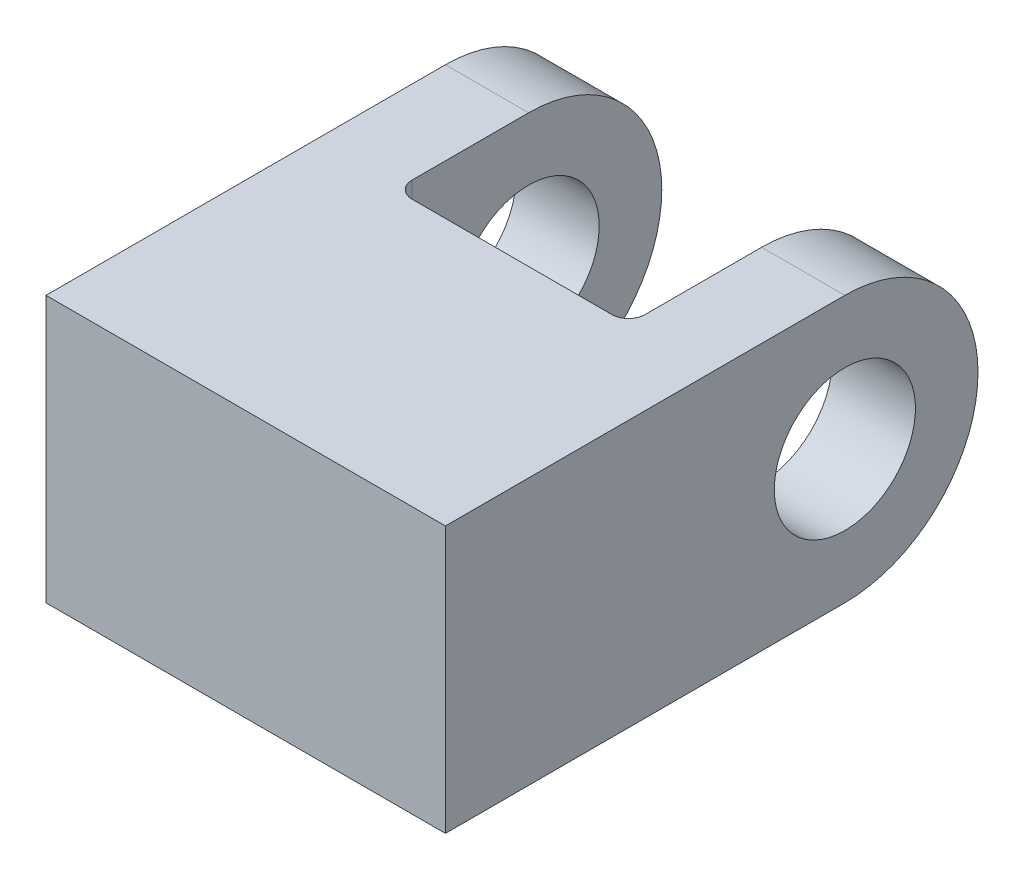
ISO-10303-21;
HEADER;
FILE_DESCRIPTION(('STEP AP214'),'2;1');
FILE_NAME('part.step','',(''),(''),'','','');
FILE_SCHEMA(('AUTOMOTIVE_DESIGN { 1 0 10303 214 1 1 1 1 }'));
ENDSEC;
DATA;
#1=APPLICATION_CONTEXT('core data for automotive mechanical design processes');
#2=APPLICATION_PROTOCOL_DEFINITION('international standard','automotive_design',2000,#1);
#3=PRODUCT_CONTEXT('',#1,'mechanical');
#4=PRODUCT('Part','Part','',(#3));
#5=PRODUCT_RELATED_PRODUCT_CATEGORY('part','',(#4));
#6=PRODUCT_DEFINITION_FORMATION('','',#4);
#7=PRODUCT_DEFINITION_CONTEXT('part definition',#1,'design');
#8=PRODUCT_DEFINITION('design','',#6,#7);
#9=PRODUCT_DEFINITION_SHAPE('','',#8);
#10=(LENGTH_UNIT() NAMED_UNIT(*) SI_UNIT(.MILLI.,.METRE.));
#11=(NAMED_UNIT(*) PLANE_ANGLE_UNIT() SI_UNIT($,.RADIAN.));
#12=(NAMED_UNIT(*) SI_UNIT($,.STERADIAN.) SOLID_ANGLE_UNIT());
#13=UNCERTAINTY_MEASURE_WITH_UNIT(LENGTH_MEASURE(1.E-05),#10,'distance_accuracy_value','');
#14=(GEOMETRIC_REPRESENTATION_CONTEXT(3) GLOBAL_UNCERTAINTY_ASSIGNED_CONTEXT((#13)) GLOBAL_UNIT_ASSIGNED_CONTEXT((#10,
#11,#12)) REPRESENTATION_CONTEXT('',''));
#15=CARTESIAN_POINT('',(0.,0.,0.));
#16=DIRECTION('',(0.,0.,1.));
#17=DIRECTION('',(1.,0.,0.));
#18=AXIS2_PLACEMENT_3D('',#15,#16,#17);
#19=CARTESIAN_POINT('',(19.05,0.,0.));
#20=DIRECTION('',(-1.,0.,0.));
#21=DIRECTION('',(0.,0.,1.));
#22=AXIS2_PLACEMENT_3D('',#19,#20,#21);
#23=CYLINDRICAL_SURFACE('',#22,12.7);
#24=DIRECTION('',(-1.,0.,0.));
#25=VECTOR('',#24,1.);
#26=CARTESIAN_POINT('',(19.05,-12.7,0.));
#27=LINE('',#26,#25);
#28=CARTESIAN_POINT('',(19.05,-12.7,0.));
#29=VERTEX_POINT('',#28);
#30=CARTESIAN_POINT('',(11.1125,-12.7,0.));
#31=VERTEX_POINT('',#30);
#32=EDGE_CURVE('E215',#29,#31,#27,.T.);
#33=ORIENTED_EDGE('',*,*,#32,.T.);
#34=CARTESIAN_POINT('',(11.1125,0.,0.));
#35=DIRECTION('',(1.,0.,0.));
#36=DIRECTION('',(0.,0.,-1.));
#37=AXIS2_PLACEMENT_3D('',#34,#35,#36);
#38=CIRCLE('',#37,12.7);
#39=CARTESIAN_POINT('',(11.1125,12.7,0.));
#40=VERTEX_POINT('',#39);
#41=EDGE_CURVE('E152',#31,#40,#38,.T.);
#42=ORIENTED_EDGE('',*,*,#41,.T.);
#43=DIRECTION('',(-1.,0.,0.));
#44=VECTOR('',#43,1.);
#45=CARTESIAN_POINT('',(19.05,12.7,0.));
#46=LINE('',#45,#44);
#47=CARTESIAN_POINT('',(19.05,12.7,0.));
#48=VERTEX_POINT('',#47);
#49=EDGE_CURVE('E138',#48,#40,#46,.T.);
#50=ORIENTED_EDGE('',*,*,#49,.F.);
#51=CARTESIAN_POINT('',(19.05,0.,0.));
#52=DIRECTION('',(1.,0.,0.));
#53=DIRECTION('',(0.,0.,-1.));
#54=AXIS2_PLACEMENT_3D('',#51,#52,#53);
#55=CIRCLE('',#54,12.7);
#56=EDGE_CURVE('E197',#29,#48,#55,.T.);
#57=ORIENTED_EDGE('',*,*,#56,.F.);
#58=EDGE_LOOP('',(#33,#42,#50,#57));
#59=FACE_BOUND('',#58,.T.);
#60=ADVANCED_FACE('F43',(#59),#23,.T.);
#61=CARTESIAN_POINT('',(19.05,0.,0.));
#62=DIRECTION('',(-1.,0.,0.));
#63=DIRECTION('',(0.,0.,1.));
#64=AXIS2_PLACEMENT_3D('',#61,#62,#63);
#65=CYLINDRICAL_SURFACE('',#64,6.731);
#66=CARTESIAN_POINT('',(11.1125,0.,0.));
#67=DIRECTION('',(1.,0.,0.));
#68=DIRECTION('',(0.,0.,-1.));
#69=AXIS2_PLACEMENT_3D('',#66,#67,#68);
#70=CIRCLE('',#69,6.731);
#71=CARTESIAN_POINT('',(11.1125,0.,6.731));
#72=VERTEX_POINT('',#71);
#73=EDGE_CURVE('E124',#72,#72,#70,.T.);
#74=CARTESIAN_POINT('',(19.05,0.,0.));
#75=DIRECTION('',(1.,0.,0.));
#76=DIRECTION('',(0.,0.,-1.));
#77=AXIS2_PLACEMENT_3D('',#74,#75,#76);
#78=CIRCLE('',#77,6.731);
#79=CARTESIAN_POINT('',(19.05,0.,6.731));
#80=VERTEX_POINT('',#79);
#81=EDGE_CURVE('E192',#80,#80,#78,.T.);
#82=CARTESIAN_POINT('',(11.1125,0.,6.731));
#83=CARTESIAN_POINT('',(11.1951822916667,0.,6.731));
#84=CARTESIAN_POINT('',(11.2778645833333,0.,6.731));
#85=CARTESIAN_POINT('',(11.4432291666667,0.,6.731));
#86=CARTESIAN_POINT('',(11.5259114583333,0.,6.731));
#87=CARTESIAN_POINT('',(11.6912760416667,0.,6.731));
#88=CARTESIAN_POINT('',(11.7739583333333,0.,6.731));
#89=CARTESIAN_POINT('',(11.9393229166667,0.,6.731));
#90=CARTESIAN_POINT('',(12.0220052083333,0.,6.731));
#91=CARTESIAN_POINT('',(12.1873697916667,0.,6.731));
#92=CARTESIAN_POINT('',(12.2700520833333,0.,6.731));
#93=CARTESIAN_POINT('',(12.4354166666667,0.,6.731));
#94=CARTESIAN_POINT('',(12.5180989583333,0.,6.731));
#95=CARTESIAN_POINT('',(12.6834635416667,0.,6.731));
#96=CARTESIAN_POINT('',(12.7661458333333,0.,6.731));
#97=CARTESIAN_POINT('',(12.9315104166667,0.,6.731));
#98=CARTESIAN_POINT('',(13.0141927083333,0.,6.731));
#99=CARTESIAN_POINT('',(13.1795572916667,0.,6.731));
#100=CARTESIAN_POINT('',(13.2622395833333,0.,6.731));
#101=CARTESIAN_POINT('',(13.4276041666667,0.,6.731));
#102=CARTESIAN_POINT('',(13.5102864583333,0.,6.731));
#103=CARTESIAN_POINT('',(13.6756510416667,0.,6.731));
#104=CARTESIAN_POINT('',(13.7583333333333,0.,6.731));
#105=CARTESIAN_POINT('',(13.9236979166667,0.,6.731));
#106=CARTESIAN_POINT('',(14.0063802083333,0.,6.731));
#107=CARTESIAN_POINT('',(14.1717447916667,0.,6.731));
#108=CARTESIAN_POINT('',(14.2544270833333,0.,6.731));
#109=CARTESIAN_POINT('',(14.4197916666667,0.,6.731));
#110=CARTESIAN_POINT('',(14.5024739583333,0.,6.731));
#111=CARTESIAN_POINT('',(14.6678385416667,0.,6.731));
#112=CARTESIAN_POINT('',(14.7505208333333,0.,6.731));
#113=CARTESIAN_POINT('',(14.9158854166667,0.,6.731));
#114=CARTESIAN_POINT('',(14.9985677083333,0.,6.731));
#115=CARTESIAN_POINT('',(15.1639322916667,0.,6.731));
#116=CARTESIAN_POINT('',(15.2466145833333,0.,6.731));
#117=CARTESIAN_POINT('',(15.4119791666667,0.,6.731));
#118=CARTESIAN_POINT('',(15.4946614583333,0.,6.731));
#119=CARTESIAN_POINT('',(15.6600260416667,0.,6.731));
#120=CARTESIAN_POINT('',(15.7427083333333,0.,6.731));
#121=CARTESIAN_POINT('',(15.9080729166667,0.,6.731));
#122=CARTESIAN_POINT('',(15.9907552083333,0.,6.731));
#123=CARTESIAN_POINT('',(16.1561197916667,0.,6.731));
#124=CARTESIAN_POINT('',(16.2388020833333,0.,6.731));
#125=CARTESIAN_POINT('',(16.4041666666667,0.,6.731));
#126=CARTESIAN_POINT('',(16.4868489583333,0.,6.731));
#127=CARTESIAN_POINT('',(16.6522135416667,0.,6.731));
#128=CARTESIAN_POINT('',(16.7348958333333,0.,6.731));
#129=CARTESIAN_POINT('',(16.9002604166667,0.,6.731));
#130=CARTESIAN_POINT('',(16.9829427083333,0.,6.731));
#131=CARTESIAN_POINT('',(17.1483072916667,0.,6.731));
#132=CARTESIAN_POINT('',(17.2309895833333,0.,6.731));
#133=CARTESIAN_POINT('',(17.3963541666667,0.,6.731));
#134=CARTESIAN_POINT('',(17.4790364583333,0.,6.731));
#135=CARTESIAN_POINT('',(17.6444010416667,0.,6.731));
#136=CARTESIAN_POINT('',(17.7270833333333,0.,6.731));
#137=CARTESIAN_POINT('',(17.8924479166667,0.,6.731));
#138=CARTESIAN_POINT('',(17.9751302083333,0.,6.731));
#139=CARTESIAN_POINT('',(18.1404947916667,0.,6.731));
#140=CARTESIAN_POINT('',(18.2231770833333,0.,6.731));
#141=CARTESIAN_POINT('',(18.3885416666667,0.,6.731));
#142=CARTESIAN_POINT('',(18.4712239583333,0.,6.731));
#143=CARTESIAN_POINT('',(18.6365885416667,0.,6.731));
#144=CARTESIAN_POINT('',(18.7192708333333,0.,6.731));
#145=CARTESIAN_POINT('',(18.8846354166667,0.,6.731));
#146=CARTESIAN_POINT('',(18.9673177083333,0.,6.731));
#147=CARTESIAN_POINT('',(19.05,0.,6.731));
#148=B_SPLINE_CURVE_WITH_KNOTS('',3,(#82,#83,#84,#85,#86,#87,#88,#89,#90,#91,#92,#93,#94,#95,
#96,#97,#98,#99,#100,#101,#102,#103,#104,#105,#106,#107,#108,#109,#110,#111,#112,#113,#114,#115,
#116,#117,#118,#119,#120,#121,#122,#123,#124,#125,#126,#127,#128,#129,#130,#131,#132,#133,#134,
#135,#136,#137,#138,#139,#140,#141,#142,#143,#144,#145,#146,#147),.UNSPECIFIED.,.F.,.F.,(4,2,2,
2,2,2,2,2,2,2,2,2,2,2,2,2,2,2,2,2,2,2,2,2,2,2,2,2,2,2,2,2,4),(0.,0.248046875,0.496093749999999,
0.744140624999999,0.9921875,1.240234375,1.48828125,1.736328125,1.984375,2.232421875,2.48046875,
2.728515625,2.9765625,3.224609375,3.47265625,3.720703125,3.96875,4.216796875,4.46484375,
4.712890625,4.9609375,5.208984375,5.45703125,5.705078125,5.953125,6.201171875,6.44921875,
6.697265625,6.9453125,7.193359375,7.44140625,7.689453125,7.9375),.UNSPECIFIED.);
#149=EDGE_CURVE('BSEAM235',#72,#80,#148,.T.);
#150=ORIENTED_EDGE('',*,*,#73,.F.);
#151=ORIENTED_EDGE('',*,*,#81,.T.);
#152=ORIENTED_EDGE('',*,*,#149,.T.);
#153=ORIENTED_EDGE('',*,*,#149,.F.);
#154=EDGE_LOOP('',(#150,#152,#151,#153));
#155=FACE_BOUND('',#154,.T.);
#156=ADVANCED_FACE('F235',(#155),#65,.F.);
#157=CARTESIAN_POINT('',(19.05,0.,0.));
#158=DIRECTION('',(1.,0.,0.));
#159=DIRECTION('',(0.,0.,-1.));
#160=AXIS2_PLACEMENT_3D('',#157,#158,#159);
#161=PLANE('',#160);
#162=ORIENTED_EDGE('',*,*,#56,.T.);
#163=DIRECTION('',(0.,0.,1.));
#164=VECTOR('',#163,1.);
#165=CARTESIAN_POINT('',(19.05,12.7,0.));
#166=LINE('',#165,#164);
#167=CARTESIAN_POINT('',(19.05,12.7,38.1));
#168=VERTEX_POINT('',#167);
#169=EDGE_CURVE('E200',#48,#168,#166,.T.);
#170=ORIENTED_EDGE('',*,*,#169,.T.);
#171=DIRECTION('',(0.,-1.,0.));
#172=VECTOR('',#171,1.);
#173=CARTESIAN_POINT('',(19.05,12.7,38.1));
#174=LINE('',#173,#172);
#175=CARTESIAN_POINT('',(19.05,-12.7,38.1));
#176=VERTEX_POINT('',#175);
#177=EDGE_CURVE('E203',#168,#176,#174,.T.);
#178=ORIENTED_EDGE('',*,*,#177,.T.);
#179=DIRECTION('',(0.,0.,-1.));
#180=VECTOR('',#179,1.);
#181=CARTESIAN_POINT('',(19.05,-12.7,38.1));
#182=LINE('',#181,#180);
#183=EDGE_CURVE('E205',#176,#29,#182,.T.);
#184=ORIENTED_EDGE('',*,*,#183,.T.);
#185=EDGE_LOOP('',(#162,#170,#178,#184));
#186=FACE_BOUND('',#185,.T.);
#187=ORIENTED_EDGE('',*,*,#81,.F.);
#188=EDGE_LOOP('',(#187));
#189=FACE_BOUND('',#188,.T.);
#190=ADVANCED_FACE('F229',(#186,#189),#161,.T.);
#191=CARTESIAN_POINT('',(-19.05,0.,0.));
#192=DIRECTION('',(1.,0.,0.));
#193=DIRECTION('',(0.,0.,-1.));
#194=AXIS2_PLACEMENT_3D('',#191,#192,#193);
#195=PLANE('',#194);
#196=CARTESIAN_POINT('',(-19.05,0.,0.));
#197=DIRECTION('',(1.,0.,0.));
#198=DIRECTION('',(0.,0.,-1.));
#199=AXIS2_PLACEMENT_3D('',#196,#197,#198);
#200=CIRCLE('',#199,12.7);
#201=CARTESIAN_POINT('',(-19.05,-12.7,0.));
#202=VERTEX_POINT('',#201);
#203=CARTESIAN_POINT('',(-19.05,12.7,0.));
#204=VERTEX_POINT('',#203);
#205=EDGE_CURVE('E137',#202,#204,#200,.T.);
#206=ORIENTED_EDGE('',*,*,#205,.F.);
#207=DIRECTION('',(0.,0.,-1.));
#208=VECTOR('',#207,1.);
#209=CARTESIAN_POINT('',(-19.05,-12.7,38.1));
#210=LINE('',#209,#208);
#211=CARTESIAN_POINT('',(-19.05,-12.7,38.1));
#212=VERTEX_POINT('',#211);
#213=EDGE_CURVE('E201',#212,#202,#210,.T.);
#214=ORIENTED_EDGE('',*,*,#213,.F.);
#215=DIRECTION('',(0.,-1.,0.));
#216=VECTOR('',#215,1.);
#217=CARTESIAN_POINT('',(-19.05,12.7,38.1));
#218=LINE('',#217,#216);
#219=CARTESIAN_POINT('',(-19.05,12.7,38.1));
#220=VERTEX_POINT('',#219);
#221=EDGE_CURVE('E211',#220,#212,#218,.T.);
#222=ORIENTED_EDGE('',*,*,#221,.F.);
#223=DIRECTION('',(0.,0.,1.));
#224=VECTOR('',#223,1.);
#225=CARTESIAN_POINT('',(-19.05,12.7,0.));
#226=LINE('',#225,#224);
#227=EDGE_CURVE('E209',#204,#220,#226,.T.);
#228=ORIENTED_EDGE('',*,*,#227,.F.);
#229=EDGE_LOOP('',(#206,#214,#222,#228));
#230=FACE_BOUND('',#229,.T.);
#231=CARTESIAN_POINT('',(-19.05,0.,0.));
#232=DIRECTION('',(1.,0.,0.));
#233=DIRECTION('',(0.,0.,-1.));
#234=AXIS2_PLACEMENT_3D('',#231,#232,#233);
#235=CIRCLE('',#234,6.731);
#236=CARTESIAN_POINT('',(-19.05,0.,6.731));
#237=VERTEX_POINT('',#236);
#238=EDGE_CURVE('E191',#237,#237,#235,.T.);
#239=ORIENTED_EDGE('',*,*,#238,.T.);
#240=EDGE_LOOP('',(#239));
#241=FACE_BOUND('',#240,.T.);
#242=ADVANCED_FACE('F224',(#230,#241),#195,.F.);
#243=CARTESIAN_POINT('',(-11.1125,12.7,0.));
#244=VERTEX_POINT('',#243);
#245=EDGE_CURVE('E129',#244,#204,#46,.T.);
#246=ORIENTED_EDGE('',*,*,#245,.F.);
#247=CARTESIAN_POINT('',(-11.1125,0.,0.));
#248=DIRECTION('',(-1.,0.,0.));
#249=DIRECTION('',(0.,0.,1.));
#250=AXIS2_PLACEMENT_3D('',#247,#248,#249);
#251=CIRCLE('',#250,12.7);
#252=CARTESIAN_POINT('',(-11.1125,-12.7,0.));
#253=VERTEX_POINT('',#252);
#254=EDGE_CURVE('E117',#244,#253,#251,.T.);
#255=ORIENTED_EDGE('',*,*,#254,.T.);
#256=EDGE_CURVE('E207',#253,#202,#27,.T.);
#257=ORIENTED_EDGE('',*,*,#256,.T.);
#258=ORIENTED_EDGE('',*,*,#205,.T.);
#259=EDGE_LOOP('',(#246,#255,#257,#258));
#260=FACE_BOUND('',#259,.T.);
#261=ADVANCED_FACE('F135',(#260),#23,.T.);
#262=CARTESIAN_POINT('',(19.05,12.7,0.));
#263=DIRECTION('',(0.,-1.,0.));
#264=DIRECTION('',(0.,0.,-1.));
#265=AXIS2_PLACEMENT_3D('',#262,#263,#264);
#266=PLANE('',#265);
#267=ORIENTED_EDGE('',*,*,#49,.T.);
#268=DIRECTION('',(0.,0.,-1.));
#269=VECTOR('',#268,1.);
#270=CARTESIAN_POINT('',(11.1125,12.7,-15.875));
#271=LINE('',#270,#269);
#272=CARTESIAN_POINT('',(11.1125,12.7,11.1125));
#273=VERTEX_POINT('',#272);
#274=EDGE_CURVE('E132',#273,#40,#271,.T.);
#275=ORIENTED_EDGE('',*,*,#274,.F.);
#276=CARTESIAN_POINT('',(9.525,12.7,11.1125));
#277=DIRECTION('',(0.,-1.,0.));
#278=DIRECTION('',(0.,0.,-1.));
#279=AXIS2_PLACEMENT_3D('',#276,#277,#278);
#280=CIRCLE('',#279,1.5875);
#281=CARTESIAN_POINT('',(9.525,12.7,12.7));
#282=VERTEX_POINT('',#281);
#283=EDGE_CURVE('E161',#273,#282,#280,.T.);
#284=ORIENTED_EDGE('',*,*,#283,.T.);
#285=DIRECTION('',(1.,0.,0.));
#286=VECTOR('',#285,1.);
#287=CARTESIAN_POINT('',(-11.1125,12.7,12.7));
#288=LINE('',#287,#286);
#289=CARTESIAN_POINT('',(-9.525,12.7,12.7));
#290=VERTEX_POINT('',#289);
#291=EDGE_CURVE('E131',#290,#282,#288,.T.);
#292=ORIENTED_EDGE('',*,*,#291,.F.);
#293=CARTESIAN_POINT('',(-9.525,12.7,11.1125));
#294=DIRECTION('',(0.,-1.,0.));
#295=DIRECTION('',(0.,0.,-1.));
#296=AXIS2_PLACEMENT_3D('',#293,#294,#295);
#297=CIRCLE('',#296,1.5875);
#298=CARTESIAN_POINT('',(-11.1125,12.7,11.1125));
#299=VERTEX_POINT('',#298);
#300=EDGE_CURVE('E51',#290,#299,#297,.T.);
#301=ORIENTED_EDGE('',*,*,#300,.T.);
#302=DIRECTION('',(0.,0.,1.));
#303=VECTOR('',#302,1.);
#304=CARTESIAN_POINT('',(-11.1125,12.7,-15.875));
#305=LINE('',#304,#303);
#306=EDGE_CURVE('E119',#244,#299,#305,.T.);
#307=ORIENTED_EDGE('',*,*,#306,.F.);
#308=ORIENTED_EDGE('',*,*,#245,.T.);
#309=ORIENTED_EDGE('',*,*,#227,.T.);
#310=DIRECTION('',(-1.,0.,0.));
#311=VECTOR('',#310,1.);
#312=CARTESIAN_POINT('',(19.05,12.7,38.1));
#313=LINE('',#312,#311);
#314=EDGE_CURVE('E139',#168,#220,#313,.T.);
#315=ORIENTED_EDGE('',*,*,#314,.F.);
#316=ORIENTED_EDGE('',*,*,#169,.F.);
#317=EDGE_LOOP('',(#267,#275,#284,#292,#301,#307,#308,#309,#315,#316));
#318=FACE_BOUND('',#317,.T.);
#319=ADVANCED_FACE('F128',(#318),#266,.F.);
#320=CARTESIAN_POINT('',(19.05,12.7,38.1));
#321=DIRECTION('',(0.,0.,-1.));
#322=DIRECTION('',(-1.,0.,0.));
#323=AXIS2_PLACEMENT_3D('',#320,#321,#322);
#324=PLANE('',#323);
#325=ORIENTED_EDGE('',*,*,#221,.T.);
#326=DIRECTION('',(-1.,0.,0.));
#327=VECTOR('',#326,1.);
#328=CARTESIAN_POINT('',(19.05,-12.7,38.1));
#329=LINE('',#328,#327);
#330=EDGE_CURVE('E143',#176,#212,#329,.T.);
#331=ORIENTED_EDGE('',*,*,#330,.F.);
#332=ORIENTED_EDGE('',*,*,#177,.F.);
#333=ORIENTED_EDGE('',*,*,#314,.T.);
#334=EDGE_LOOP('',(#325,#331,#332,#333));
#335=FACE_BOUND('',#334,.T.);
#336=ADVANCED_FACE('F227',(#335),#324,.F.);
#337=CARTESIAN_POINT('',(19.05,-12.7,38.1));
#338=DIRECTION('',(0.,1.,0.));
#339=DIRECTION('',(0.,0.,1.));
#340=AXIS2_PLACEMENT_3D('',#337,#338,#339);
#341=PLANE('',#340);
#342=DIRECTION('',(0.,0.,1.));
#343=VECTOR('',#342,1.);
#344=CARTESIAN_POINT('',(-11.1125,-12.7,-15.875));
#345=LINE('',#344,#343);
#346=CARTESIAN_POINT('',(-11.1125,-12.7,11.1125));
#347=VERTEX_POINT('',#346);
#348=EDGE_CURVE('E120',#253,#347,#345,.T.);
#349=ORIENTED_EDGE('',*,*,#348,.T.);
#350=CARTESIAN_POINT('',(-9.525,-12.7,11.1125));
#351=DIRECTION('',(0.,1.,0.));
#352=DIRECTION('',(0.,0.,1.));
#353=AXIS2_PLACEMENT_3D('',#350,#351,#352);
#354=CIRCLE('',#353,1.5875);
#355=CARTESIAN_POINT('',(-9.525,-12.7,12.7));
#356=VERTEX_POINT('',#355);
#357=EDGE_CURVE('E11',#347,#356,#354,.T.);
#358=ORIENTED_EDGE('',*,*,#357,.T.);
#359=DIRECTION('',(1.,0.,0.));
#360=VECTOR('',#359,1.);
#361=CARTESIAN_POINT('',(-11.1125,-12.7,12.7));
#362=LINE('',#361,#360);
#363=CARTESIAN_POINT('',(9.525,-12.7,12.7));
#364=VERTEX_POINT('',#363);
#365=EDGE_CURVE('E149',#356,#364,#362,.T.);
#366=ORIENTED_EDGE('',*,*,#365,.T.);
#367=CARTESIAN_POINT('',(9.525,-12.7,11.1125));
#368=DIRECTION('',(0.,1.,0.));
#369=DIRECTION('',(0.,0.,1.));
#370=AXIS2_PLACEMENT_3D('',#367,#368,#369);
#371=CIRCLE('',#370,1.5875);
#372=CARTESIAN_POINT('',(11.1125,-12.7,11.1125));
#373=VERTEX_POINT('',#372);
#374=EDGE_CURVE('E163',#364,#373,#371,.T.);
#375=ORIENTED_EDGE('',*,*,#374,.T.);
#376=DIRECTION('',(0.,0.,-1.));
#377=VECTOR('',#376,1.);
#378=CARTESIAN_POINT('',(11.1125,-12.7,-15.875));
#379=LINE('',#378,#377);
#380=EDGE_CURVE('E170',#373,#31,#379,.T.);
#381=ORIENTED_EDGE('',*,*,#380,.T.);
#382=ORIENTED_EDGE('',*,*,#32,.F.);
#383=ORIENTED_EDGE('',*,*,#183,.F.);
#384=ORIENTED_EDGE('',*,*,#330,.T.);
#385=ORIENTED_EDGE('',*,*,#213,.T.);
#386=ORIENTED_EDGE('',*,*,#256,.F.);
#387=EDGE_LOOP('',(#349,#358,#366,#375,#381,#382,#383,#384,#385,#386));
#388=FACE_BOUND('',#387,.T.);
#389=ADVANCED_FACE('F168',(#388),#341,.F.);
#390=CARTESIAN_POINT('',(-11.1125,0.,0.));
#391=DIRECTION('',(-1.,0.,0.));
#392=DIRECTION('',(0.,0.,1.));
#393=AXIS2_PLACEMENT_3D('',#390,#391,#392);
#394=CIRCLE('',#393,6.731);
#395=CARTESIAN_POINT('',(-11.1125,0.,6.731));
#396=VERTEX_POINT('',#395);
#397=EDGE_CURVE('E125',#396,#396,#394,.T.);
#398=CARTESIAN_POINT('',(-11.1125,0.,6.731));
#399=CARTESIAN_POINT('',(-11.1951822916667,0.,6.731));
#400=CARTESIAN_POINT('',(-11.2778645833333,0.,6.731));
#401=CARTESIAN_POINT('',(-11.4432291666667,0.,6.731));
#402=CARTESIAN_POINT('',(-11.5259114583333,0.,6.731));
#403=CARTESIAN_POINT('',(-11.6912760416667,0.,6.731));
#404=CARTESIAN_POINT('',(-11.7739583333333,0.,6.731));
#405=CARTESIAN_POINT('',(-11.9393229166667,0.,6.731));
#406=CARTESIAN_POINT('',(-12.0220052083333,0.,6.731));
#407=CARTESIAN_POINT('',(-12.1873697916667,0.,6.731));
#408=CARTESIAN_POINT('',(-12.2700520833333,0.,6.731));
#409=CARTESIAN_POINT('',(-12.4354166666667,0.,6.731));
#410=CARTESIAN_POINT('',(-12.5180989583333,0.,6.731));
#411=CARTESIAN_POINT('',(-12.6834635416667,0.,6.731));
#412=CARTESIAN_POINT('',(-12.7661458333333,0.,6.731));
#413=CARTESIAN_POINT('',(-12.9315104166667,0.,6.731));
#414=CARTESIAN_POINT('',(-13.0141927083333,0.,6.731));
#415=CARTESIAN_POINT('',(-13.1795572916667,0.,6.731));
#416=CARTESIAN_POINT('',(-13.2622395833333,0.,6.731));
#417=CARTESIAN_POINT('',(-13.4276041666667,0.,6.731));
#418=CARTESIAN_POINT('',(-13.5102864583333,0.,6.731));
#419=CARTESIAN_POINT('',(-13.6756510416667,0.,6.731));
#420=CARTESIAN_POINT('',(-13.7583333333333,0.,6.731));
#421=CARTESIAN_POINT('',(-13.9236979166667,0.,6.731));
#422=CARTESIAN_POINT('',(-14.0063802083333,0.,6.731));
#423=CARTESIAN_POINT('',(-14.1717447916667,0.,6.731));
#424=CARTESIAN_POINT('',(-14.2544270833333,0.,6.731));
#425=CARTESIAN_POINT('',(-14.4197916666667,0.,6.731));
#426=CARTESIAN_POINT('',(-14.5024739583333,0.,6.731));
#427=CARTESIAN_POINT('',(-14.6678385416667,0.,6.731));
#428=CARTESIAN_POINT('',(-14.7505208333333,0.,6.731));
#429=CARTESIAN_POINT('',(-14.9158854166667,0.,6.731));
#430=CARTESIAN_POINT('',(-14.9985677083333,0.,6.731));
#431=CARTESIAN_POINT('',(-15.1639322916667,0.,6.731));
#432=CARTESIAN_POINT('',(-15.2466145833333,0.,6.731));
#433=CARTESIAN_POINT('',(-15.4119791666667,0.,6.731));
#434=CARTESIAN_POINT('',(-15.4946614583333,0.,6.731));
#435=CARTESIAN_POINT('',(-15.6600260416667,0.,6.731));
#436=CARTESIAN_POINT('',(-15.7427083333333,0.,6.731));
#437=CARTESIAN_POINT('',(-15.9080729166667,0.,6.731));
#438=CARTESIAN_POINT('',(-15.9907552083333,0.,6.731));
#439=CARTESIAN_POINT('',(-16.1561197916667,0.,6.731));
#440=CARTESIAN_POINT('',(-16.2388020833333,0.,6.731));
#441=CARTESIAN_POINT('',(-16.4041666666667,0.,6.731));
#442=CARTESIAN_POINT('',(-16.4868489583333,0.,6.731));
#443=CARTESIAN_POINT('',(-16.6522135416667,0.,6.731));
#444=CARTESIAN_POINT('',(-16.7348958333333,0.,6.731));
#445=CARTESIAN_POINT('',(-16.9002604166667,0.,6.731));
#446=CARTESIAN_POINT('',(-16.9829427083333,0.,6.731));
#447=CARTESIAN_POINT('',(-17.1483072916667,0.,6.731));
#448=CARTESIAN_POINT('',(-17.2309895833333,0.,6.731));
#449=CARTESIAN_POINT('',(-17.3963541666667,0.,6.731));
#450=CARTESIAN_POINT('',(-17.4790364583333,0.,6.731));
#451=CARTESIAN_POINT('',(-17.6444010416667,0.,6.731));
#452=CARTESIAN_POINT('',(-17.7270833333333,0.,6.731));
#453=CARTESIAN_POINT('',(-17.8924479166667,0.,6.731));
#454=CARTESIAN_POINT('',(-17.9751302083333,0.,6.731));
#455=CARTESIAN_POINT('',(-18.1404947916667,0.,6.731));
#456=CARTESIAN_POINT('',(-18.2231770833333,0.,6.731));
#457=CARTESIAN_POINT('',(-18.3885416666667,0.,6.731));
#458=CARTESIAN_POINT('',(-18.4712239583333,0.,6.731));
#459=CARTESIAN_POINT('',(-18.6365885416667,0.,6.731));
#460=CARTESIAN_POINT('',(-18.7192708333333,0.,6.731));
#461=CARTESIAN_POINT('',(-18.8846354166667,0.,6.731));
#462=CARTESIAN_POINT('',(-18.9673177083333,0.,6.731));
#463=CARTESIAN_POINT('',(-19.05,0.,6.731));
#464=B_SPLINE_CURVE_WITH_KNOTS('',3,(#398,#399,#400,#401,#402,#403,#404,#405,#406,#407,#408,
#409,#410,#411,#412,#413,#414,#415,#416,#417,#418,#419,#420,#421,#422,#423,#424,#425,#426,#427,
#428,#429,#430,#431,#432,#433,#434,#435,#436,#437,#438,#439,#440,#441,#442,#443,#444,#445,#446,
#447,#448,#449,#450,#451,#452,#453,#454,#455,#456,#457,#458,#459,#460,#461,#462,#463),
.UNSPECIFIED.,.F.,.F.,(4,2,2,2,2,2,2,2,2,2,2,2,2,2,2,2,2,2,2,2,2,2,2,2,2,2,2,2,2,2,2,2,4),(0.,
0.248046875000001,0.496093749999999,0.744140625,0.992187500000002,1.240234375,1.48828125,
1.736328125,1.984375,2.232421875,2.48046875,2.728515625,2.9765625,3.224609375,3.47265625,
3.720703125,3.96875,4.216796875,4.46484375,4.712890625,4.9609375,5.208984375,5.45703125,
5.705078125,5.953125,6.201171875,6.44921875,6.697265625,6.94531250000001,7.193359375,7.44140625,
7.68945312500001,7.9375),.UNSPECIFIED.);
#465=EDGE_CURVE('BSEAM242',#396,#237,#464,.T.);
#466=ORIENTED_EDGE('',*,*,#397,.F.);
#467=ORIENTED_EDGE('',*,*,#238,.F.);
#468=ORIENTED_EDGE('',*,*,#465,.T.);
#469=ORIENTED_EDGE('',*,*,#465,.F.);
#470=EDGE_LOOP('',(#466,#468,#467,#469));
#471=FACE_BOUND('',#470,.T.);
#472=ADVANCED_FACE('F242',(#471),#65,.F.);
#473=CARTESIAN_POINT('',(11.1125,-12.7,-15.875));
#474=DIRECTION('',(1.,0.,0.));
#475=DIRECTION('',(0.,0.,-1.));
#476=AXIS2_PLACEMENT_3D('',#473,#474,#475);
#477=PLANE('',#476);
#478=ORIENTED_EDGE('',*,*,#73,.T.);
#479=EDGE_LOOP('',(#478));
#480=FACE_BOUND('',#479,.T.);
#481=ORIENTED_EDGE('',*,*,#380,.F.);
#482=DIRECTION('',(0.,1.,0.));
#483=VECTOR('',#482,1.);
#484=CARTESIAN_POINT('',(11.1125,12.7,11.1125));
#485=LINE('',#484,#483);
#486=EDGE_CURVE('E141',#373,#273,#485,.T.);
#487=ORIENTED_EDGE('',*,*,#486,.T.);
#488=ORIENTED_EDGE('',*,*,#274,.T.);
#489=ORIENTED_EDGE('',*,*,#41,.F.);
#490=EDGE_LOOP('',(#481,#487,#488,#489));
#491=FACE_BOUND('',#490,.T.);
#492=ADVANCED_FACE('F177',(#480,#491),#477,.F.);
#493=CARTESIAN_POINT('',(-11.1125,-12.7,-15.875));
#494=DIRECTION('',(-1.,0.,0.));
#495=DIRECTION('',(0.,0.,1.));
#496=AXIS2_PLACEMENT_3D('',#493,#494,#495);
#497=PLANE('',#496);
#498=ORIENTED_EDGE('',*,*,#397,.T.);
#499=EDGE_LOOP('',(#498));
#500=FACE_BOUND('',#499,.T.);
#501=ORIENTED_EDGE('',*,*,#306,.T.);
#502=DIRECTION('',(0.,1.,0.));
#503=VECTOR('',#502,1.);
#504=CARTESIAN_POINT('',(-11.1125,-12.7,11.1125));
#505=LINE('',#504,#503);
#506=EDGE_CURVE('E58',#299,#347,#505,.F.);
#507=ORIENTED_EDGE('',*,*,#506,.T.);
#508=ORIENTED_EDGE('',*,*,#348,.F.);
#509=ORIENTED_EDGE('',*,*,#254,.F.);
#510=EDGE_LOOP('',(#501,#507,#508,#509));
#511=FACE_BOUND('',#510,.T.);
#512=ADVANCED_FACE('F118',(#500,#511),#497,.F.);
#513=CARTESIAN_POINT('',(-11.1125,-12.7,12.7));
#514=DIRECTION('',(0.,0.,1.));
#515=DIRECTION('',(1.,0.,0.));
#516=AXIS2_PLACEMENT_3D('',#513,#514,#515);
#517=PLANE('',#516);
#518=ORIENTED_EDGE('',*,*,#291,.T.);
#519=DIRECTION('',(0.,1.,0.));
#520=VECTOR('',#519,1.);
#521=CARTESIAN_POINT('',(9.525,-12.7,12.7));
#522=LINE('',#521,#520);
#523=EDGE_CURVE('E158',#282,#364,#522,.F.);
#524=ORIENTED_EDGE('',*,*,#523,.T.);
#525=ORIENTED_EDGE('',*,*,#365,.F.);
#526=DIRECTION('',(0.,1.,0.));
#527=VECTOR('',#526,1.);
#528=CARTESIAN_POINT('',(-9.525,12.7,12.7));
#529=LINE('',#528,#527);
#530=EDGE_CURVE('E155',#356,#290,#529,.T.);
#531=ORIENTED_EDGE('',*,*,#530,.T.);
#532=EDGE_LOOP('',(#518,#524,#525,#531));
#533=FACE_BOUND('',#532,.T.);
#534=ADVANCED_FACE('F185',(#533),#517,.F.);
#535=CARTESIAN_POINT('',(9.525,-12.7,11.1125));
#536=DIRECTION('',(0.,-1.,0.));
#537=DIRECTION('',(0.,0.,-1.));
#538=AXIS2_PLACEMENT_3D('',#535,#536,#537);
#539=CYLINDRICAL_SURFACE('',#538,1.5875);
#540=ORIENTED_EDGE('',*,*,#374,.F.);
#541=ORIENTED_EDGE('',*,*,#523,.F.);
#542=ORIENTED_EDGE('',*,*,#283,.F.);
#543=ORIENTED_EDGE('',*,*,#486,.F.);
#544=EDGE_LOOP('',(#540,#541,#542,#543));
#545=FACE_BOUND('',#544,.T.);
#546=ADVANCED_FACE('F182',(#545),#539,.F.);
#547=CARTESIAN_POINT('',(-9.525,-12.7,11.1125));
#548=DIRECTION('',(0.,-1.,0.));
#549=DIRECTION('',(0.,0.,-1.));
#550=AXIS2_PLACEMENT_3D('',#547,#548,#549);
#551=CYLINDRICAL_SURFACE('',#550,1.5875);
#552=ORIENTED_EDGE('',*,*,#357,.F.);
#553=ORIENTED_EDGE('',*,*,#506,.F.);
#554=ORIENTED_EDGE('',*,*,#300,.F.);
#555=ORIENTED_EDGE('',*,*,#530,.F.);
#556=EDGE_LOOP('',(#552,#553,#554,#555));
#557=FACE_BOUND('',#556,.T.);
#558=ADVANCED_FACE('F45',(#557),#551,.F.);
#559=CLOSED_SHELL('',(#60,#156,#190,#242,#261,#319,#336,#389,#472,#492,#512,#534,#546,#558));
#560=MANIFOLD_SOLID_BREP('B2',#559);
#561=ADVANCED_BREP_SHAPE_REPRESENTATION('',(#18,#560),#14);
#562=SHAPE_DEFINITION_REPRESENTATION(#9,#561);
ENDSEC;
END-ISO-10303-21;
